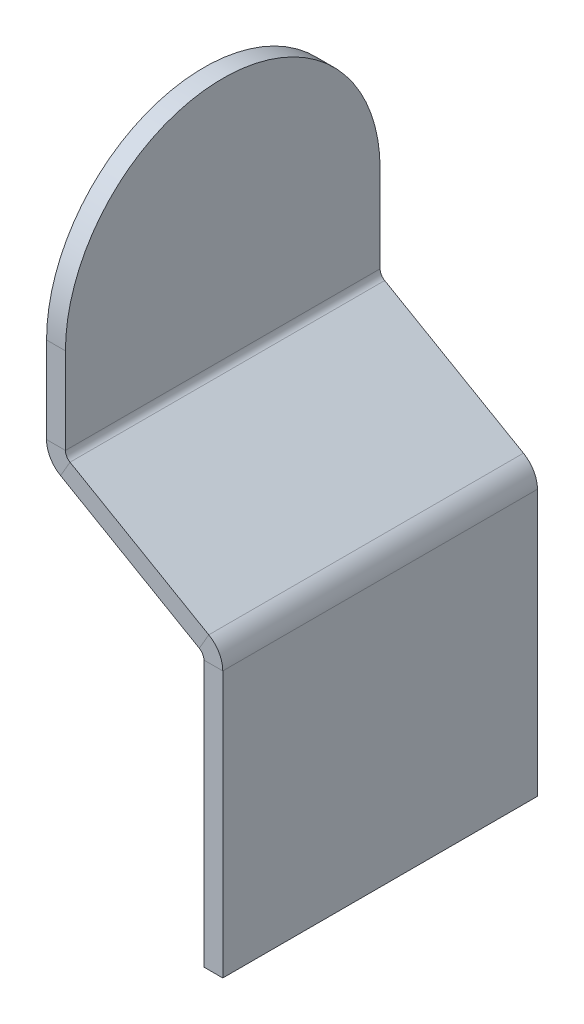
ISO-10303-21;
HEADER;
FILE_DESCRIPTION(('STEP AP214'),'2;1');
FILE_NAME('part.step','',(''),(''),'','','');
FILE_SCHEMA(('AUTOMOTIVE_DESIGN { 1 0 10303 214 1 1 1 1 }'));
ENDSEC;
DATA;
#1=APPLICATION_CONTEXT('core data for automotive mechanical design processes');
#2=APPLICATION_PROTOCOL_DEFINITION('international standard','automotive_design',2000,#1);
#3=PRODUCT_CONTEXT('',#1,'mechanical');
#4=PRODUCT('Part','Part','',(#3));
#5=PRODUCT_RELATED_PRODUCT_CATEGORY('part','',(#4));
#6=PRODUCT_DEFINITION_FORMATION('','',#4);
#7=PRODUCT_DEFINITION_CONTEXT('part definition',#1,'design');
#8=PRODUCT_DEFINITION('design','',#6,#7);
#9=PRODUCT_DEFINITION_SHAPE('','',#8);
#10=(LENGTH_UNIT() NAMED_UNIT(*) SI_UNIT(.MILLI.,.METRE.));
#11=(NAMED_UNIT(*) PLANE_ANGLE_UNIT() SI_UNIT($,.RADIAN.));
#12=(NAMED_UNIT(*) SI_UNIT($,.STERADIAN.) SOLID_ANGLE_UNIT());
#13=UNCERTAINTY_MEASURE_WITH_UNIT(LENGTH_MEASURE(1.E-05),#10,'distance_accuracy_value','');
#14=(GEOMETRIC_REPRESENTATION_CONTEXT(3) GLOBAL_UNCERTAINTY_ASSIGNED_CONTEXT((#13)) GLOBAL_UNIT_ASSIGNED_CONTEXT((#10,
#11,#12)) REPRESENTATION_CONTEXT('',''));
#15=CARTESIAN_POINT('',(0.,0.,0.));
#16=DIRECTION('',(0.,0.,1.));
#17=DIRECTION('',(1.,0.,0.));
#18=AXIS2_PLACEMENT_3D('',#15,#16,#17);
#19=CARTESIAN_POINT('',(19.5806378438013,10.5861086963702,25.4));
#20=DIRECTION('',(-0.499999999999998,-0.86602540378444,0.));
#21=DIRECTION('',(0.,0.,1.));
#22=AXIS2_PLACEMENT_3D('',#19,#20,#21);
#23=PLANE('',#22);
#24=DIRECTION('',(-0.86602540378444,0.499999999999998,0.));
#25=VECTOR('',#24,1.);
#26=CARTESIAN_POINT('',(19.5806378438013,10.5861086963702,25.4));
#27=LINE('',#26,#25);
#28=CARTESIAN_POINT('',(-0.368300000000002,22.103633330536,25.4));
#29=VERTEX_POINT('',#28);
#30=CARTESIAN_POINT('',(-11.5697,28.5707646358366,25.4));
#31=VERTEX_POINT('',#30);
#32=EDGE_CURVE('E37',#29,#31,#27,.T.);
#33=ORIENTED_EDGE('',*,*,#32,.T.);
#34=DIRECTION('',(0.,0.,-1.));
#35=VECTOR('',#34,1.);
#36=CARTESIAN_POINT('',(-11.5697,28.5707646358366,25.4));
#37=LINE('',#36,#35);
#38=CARTESIAN_POINT('',(-11.5697000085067,28.5707646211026,0.));
#39=VERTEX_POINT('',#38);
#40=EDGE_CURVE('E222',#31,#39,#37,.T.);
#41=ORIENTED_EDGE('',*,*,#40,.T.);
#42=DIRECTION('',(-0.86602540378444,0.499999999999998,0.));
#43=VECTOR('',#42,1.);
#44=CARTESIAN_POINT('',(19.5806378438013,10.5861086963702,0.));
#45=LINE('',#44,#43);
#46=CARTESIAN_POINT('',(-0.368299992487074,22.1036333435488,0.));
#47=VERTEX_POINT('',#46);
#48=EDGE_CURVE('E229',#47,#39,#45,.T.);
#49=ORIENTED_EDGE('',*,*,#48,.F.);
#50=DIRECTION('',(0.,0.,-1.));
#51=VECTOR('',#50,1.);
#52=CARTESIAN_POINT('',(-0.368300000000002,22.103633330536,25.4));
#53=LINE('',#52,#51);
#54=EDGE_CURVE('E212',#29,#47,#53,.T.);
#55=ORIENTED_EDGE('',*,*,#54,.F.);
#56=EDGE_LOOP('',(#33,#41,#49,#55));
#57=FACE_BOUND('',#56,.T.);
#58=ADVANCED_FACE('F33',(#57),#23,.T.);
#59=CARTESIAN_POINT('',(20.3426378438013,11.9059314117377,25.4));
#60=DIRECTION('',(0.,0.,1.));
#61=DIRECTION('',(0.499999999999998,0.86602540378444,0.));
#62=AXIS2_PLACEMENT_3D('',#59,#60,#61);
#63=PLANE('',#62);
#64=DIRECTION('',(-0.86602540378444,0.499999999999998,0.));
#65=VECTOR('',#64,1.);
#66=CARTESIAN_POINT('',(20.3426378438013,11.9059314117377,25.4));
#67=LINE('',#66,#65);
#68=CARTESIAN_POINT('',(0.3937,23.4234560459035,25.4));
#69=VERTEX_POINT('',#68);
#70=CARTESIAN_POINT('',(-10.8077,29.8905873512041,25.4));
#71=VERTEX_POINT('',#70);
#72=EDGE_CURVE('E58',#69,#71,#67,.T.);
#73=ORIENTED_EDGE('',*,*,#72,.T.);
#74=DIRECTION('',(-0.499999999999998,-0.86602540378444,0.));
#75=VECTOR('',#74,1.);
#76=CARTESIAN_POINT('',(-10.8077,29.8905873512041,25.4));
#77=LINE('',#76,#75);
#78=EDGE_CURVE('E225',#71,#31,#77,.T.);
#79=ORIENTED_EDGE('',*,*,#78,.T.);
#80=ORIENTED_EDGE('',*,*,#32,.F.);
#81=DIRECTION('',(-0.499999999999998,-0.86602540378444,0.));
#82=VECTOR('',#81,1.);
#83=CARTESIAN_POINT('',(0.393699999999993,23.4234560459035,25.4));
#84=LINE('',#83,#82);
#85=EDGE_CURVE('E219',#69,#29,#84,.T.);
#86=ORIENTED_EDGE('',*,*,#85,.F.);
#87=EDGE_LOOP('',(#73,#79,#80,#86));
#88=FACE_BOUND('',#87,.T.);
#89=ADVANCED_FACE('F236',(#88),#63,.T.);
#90=CARTESIAN_POINT('',(20.3426378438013,11.9059314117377,0.));
#91=DIRECTION('',(0.,0.,1.));
#92=DIRECTION('',(0.499999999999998,0.86602540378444,0.));
#93=AXIS2_PLACEMENT_3D('',#90,#91,#92);
#94=PLANE('',#93);
#95=DIRECTION('',(-0.499999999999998,-0.86602540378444,0.));
#96=VECTOR('',#95,1.);
#97=CARTESIAN_POINT('',(-10.8077,29.8905873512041,0.));
#98=LINE('',#97,#96);
#99=CARTESIAN_POINT('',(-10.8077,29.8905873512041,0.));
#100=VERTEX_POINT('',#99);
#101=EDGE_CURVE('E12',#100,#39,#98,.T.);
#102=ORIENTED_EDGE('',*,*,#101,.F.);
#103=DIRECTION('',(-0.86602540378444,0.499999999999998,0.));
#104=VECTOR('',#103,1.);
#105=CARTESIAN_POINT('',(20.3426378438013,11.9059314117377,0.));
#106=LINE('',#105,#104);
#107=CARTESIAN_POINT('',(0.3937,23.4234560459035,0.));
#108=VERTEX_POINT('',#107);
#109=EDGE_CURVE('E50',#108,#100,#106,.T.);
#110=ORIENTED_EDGE('',*,*,#109,.F.);
#111=DIRECTION('',(-0.499999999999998,-0.86602540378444,0.));
#112=VECTOR('',#111,1.);
#113=CARTESIAN_POINT('',(0.393699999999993,23.4234560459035,0.));
#114=LINE('',#113,#112);
#115=EDGE_CURVE('E215',#108,#47,#114,.T.);
#116=ORIENTED_EDGE('',*,*,#115,.T.);
#117=ORIENTED_EDGE('',*,*,#48,.T.);
#118=EDGE_LOOP('',(#102,#110,#116,#117));
#119=FACE_BOUND('',#118,.T.);
#120=ADVANCED_FACE('F35',(#119),#94,.F.);
#121=CARTESIAN_POINT('',(20.3426378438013,11.9059314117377,25.4));
#122=DIRECTION('',(-0.499999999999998,-0.86602540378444,0.));
#123=DIRECTION('',(0.,0.,1.));
#124=AXIS2_PLACEMENT_3D('',#121,#122,#123);
#125=PLANE('',#124);
#126=DIRECTION('',(0.,0.,-1.));
#127=VECTOR('',#126,1.);
#128=CARTESIAN_POINT('',(-10.8077,29.8905873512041,25.4));
#129=LINE('',#128,#127);
#130=EDGE_CURVE('E42',#71,#100,#129,.T.);
#131=ORIENTED_EDGE('',*,*,#130,.F.);
#132=ORIENTED_EDGE('',*,*,#72,.F.);
#133=DIRECTION('',(0.,0.,-1.));
#134=VECTOR('',#133,1.);
#135=CARTESIAN_POINT('',(0.393699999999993,23.4234560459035,25.4));
#136=LINE('',#135,#134);
#137=EDGE_CURVE('E217',#69,#108,#136,.T.);
#138=ORIENTED_EDGE('',*,*,#137,.T.);
#139=ORIENTED_EDGE('',*,*,#109,.T.);
#140=EDGE_LOOP('',(#131,#132,#138,#139));
#141=FACE_BOUND('',#140,.T.);
#142=ADVANCED_FACE('F279',(#141),#125,.F.);
#143=CARTESIAN_POINT('',(1.524,0.,25.4));
#144=DIRECTION('',(0.,-1.,0.));
#145=DIRECTION('',(0.,0.,-1.));
#146=AXIS2_PLACEMENT_3D('',#143,#144,#145);
#147=PLANE('',#146);
#148=DIRECTION('',(-1.,0.,0.));
#149=VECTOR('',#148,1.);
#150=CARTESIAN_POINT('',(1.524,0.,0.));
#151=LINE('',#150,#149);
#152=CARTESIAN_POINT('',(1.524,0.,0.));
#153=VERTEX_POINT('',#152);
#154=CARTESIAN_POINT('',(0.,0.,0.));
#155=VERTEX_POINT('',#154);
#156=EDGE_CURVE('E194',#153,#155,#151,.T.);
#157=ORIENTED_EDGE('',*,*,#156,.F.);
#158=DIRECTION('',(0.,0.,-1.));
#159=VECTOR('',#158,1.);
#160=CARTESIAN_POINT('',(1.524,0.,25.4));
#161=LINE('',#160,#159);
#162=CARTESIAN_POINT('',(1.524,0.,25.4));
#163=VERTEX_POINT('',#162);
#164=EDGE_CURVE('E190',#163,#153,#161,.T.);
#165=ORIENTED_EDGE('',*,*,#164,.F.);
#166=DIRECTION('',(-1.,0.,0.));
#167=VECTOR('',#166,1.);
#168=CARTESIAN_POINT('',(1.524,0.,25.4));
#169=LINE('',#168,#167);
#170=CARTESIAN_POINT('',(0.,0.,25.4));
#171=VERTEX_POINT('',#170);
#172=EDGE_CURVE('E204',#163,#171,#169,.T.);
#173=ORIENTED_EDGE('',*,*,#172,.T.);
#174=DIRECTION('',(0.,0.,-1.));
#175=VECTOR('',#174,1.);
#176=CARTESIAN_POINT('',(0.,0.,25.4));
#177=LINE('',#176,#175);
#178=EDGE_CURVE('E202',#171,#155,#177,.T.);
#179=ORIENTED_EDGE('',*,*,#178,.T.);
#180=EDGE_LOOP('',(#157,#165,#173,#179));
#181=FACE_BOUND('',#180,.T.);
#182=ADVANCED_FACE('F281',(#181),#147,.T.);
#183=CARTESIAN_POINT('',(0.,0.,25.4));
#184=DIRECTION('',(-1.,0.,0.));
#185=DIRECTION('',(0.,0.,1.));
#186=AXIS2_PLACEMENT_3D('',#183,#184,#185);
#187=PLANE('',#186);
#188=DIRECTION('',(0.,1.,0.));
#189=VECTOR('',#188,1.);
#190=CARTESIAN_POINT('',(0.,0.,25.4));
#191=LINE('',#190,#189);
#192=CARTESIAN_POINT('',(0.,21.4657190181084,25.4));
#193=VERTEX_POINT('',#192);
#194=EDGE_CURVE('E200',#171,#193,#191,.T.);
#195=ORIENTED_EDGE('',*,*,#194,.T.);
#196=DIRECTION('',(0.,0.,-1.));
#197=VECTOR('',#196,1.);
#198=CARTESIAN_POINT('',(0.,21.4657190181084,25.4));
#199=LINE('',#198,#197);
#200=CARTESIAN_POINT('',(1.50258540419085E-08,21.4657190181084,0.));
#201=VERTEX_POINT('',#200);
#202=EDGE_CURVE('E197',#193,#201,#199,.T.);
#203=ORIENTED_EDGE('',*,*,#202,.T.);
#204=DIRECTION('',(0.,1.,0.));
#205=VECTOR('',#204,1.);
#206=CARTESIAN_POINT('',(0.,0.,0.));
#207=LINE('',#206,#205);
#208=EDGE_CURVE('E192',#155,#201,#207,.T.);
#209=ORIENTED_EDGE('',*,*,#208,.F.);
#210=ORIENTED_EDGE('',*,*,#178,.F.);
#211=EDGE_LOOP('',(#195,#203,#209,#210));
#212=FACE_BOUND('',#211,.T.);
#213=ADVANCED_FACE('F286',(#212),#187,.T.);
#214=CARTESIAN_POINT('',(1.524,0.,0.));
#215=DIRECTION('',(0.,0.,1.));
#216=DIRECTION('',(1.,0.,0.));
#217=AXIS2_PLACEMENT_3D('',#214,#215,#216);
#218=PLANE('',#217);
#219=DIRECTION('',(-1.,0.,0.));
#220=VECTOR('',#219,1.);
#221=CARTESIAN_POINT('',(1.524,21.4657190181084,0.));
#222=LINE('',#221,#220);
#223=CARTESIAN_POINT('',(1.524,21.4657190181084,0.));
#224=VERTEX_POINT('',#223);
#225=EDGE_CURVE('E207',#224,#201,#222,.T.);
#226=ORIENTED_EDGE('',*,*,#225,.F.);
#227=DIRECTION('',(0.,1.,0.));
#228=VECTOR('',#227,1.);
#229=CARTESIAN_POINT('',(1.524,0.,0.));
#230=LINE('',#229,#228);
#231=EDGE_CURVE('E188',#153,#224,#230,.T.);
#232=ORIENTED_EDGE('',*,*,#231,.F.);
#233=ORIENTED_EDGE('',*,*,#156,.T.);
#234=ORIENTED_EDGE('',*,*,#208,.T.);
#235=EDGE_LOOP('',(#226,#232,#233,#234));
#236=FACE_BOUND('',#235,.T.);
#237=ADVANCED_FACE('F304',(#236),#218,.F.);
#238=CARTESIAN_POINT('',(1.524,0.,25.4));
#239=DIRECTION('',(-1.,0.,0.));
#240=DIRECTION('',(0.,0.,1.));
#241=AXIS2_PLACEMENT_3D('',#238,#239,#240);
#242=PLANE('',#241);
#243=DIRECTION('',(0.,0.,-1.));
#244=VECTOR('',#243,1.);
#245=CARTESIAN_POINT('',(1.524,21.4657190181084,25.4));
#246=LINE('',#245,#244);
#247=CARTESIAN_POINT('',(1.524,21.4657190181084,25.4));
#248=VERTEX_POINT('',#247);
#249=EDGE_CURVE('E182',#248,#224,#246,.T.);
#250=ORIENTED_EDGE('',*,*,#249,.F.);
#251=DIRECTION('',(0.,1.,0.));
#252=VECTOR('',#251,1.);
#253=CARTESIAN_POINT('',(1.524,0.,25.4));
#254=LINE('',#253,#252);
#255=EDGE_CURVE('E186',#163,#248,#254,.T.);
#256=ORIENTED_EDGE('',*,*,#255,.F.);
#257=ORIENTED_EDGE('',*,*,#164,.T.);
#258=ORIENTED_EDGE('',*,*,#231,.T.);
#259=EDGE_LOOP('',(#250,#256,#257,#258));
#260=FACE_BOUND('',#259,.T.);
#261=ADVANCED_FACE('F315',(#260),#242,.F.);
#262=CARTESIAN_POINT('',(1.524,0.,25.4));
#263=DIRECTION('',(0.,0.,1.));
#264=DIRECTION('',(1.,0.,0.));
#265=AXIS2_PLACEMENT_3D('',#262,#263,#264);
#266=PLANE('',#265);
#267=ORIENTED_EDGE('',*,*,#255,.T.);
#268=DIRECTION('',(-1.,0.,0.));
#269=VECTOR('',#268,1.);
#270=CARTESIAN_POINT('',(1.524,21.4657190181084,25.4));
#271=LINE('',#270,#269);
#272=EDGE_CURVE('E183',#248,#193,#271,.T.);
#273=ORIENTED_EDGE('',*,*,#272,.T.);
#274=ORIENTED_EDGE('',*,*,#194,.F.);
#275=ORIENTED_EDGE('',*,*,#172,.F.);
#276=EDGE_LOOP('',(#267,#273,#274,#275));
#277=FACE_BOUND('',#276,.T.);
#278=ADVANCED_FACE('F277',(#277),#266,.T.);
#279=CARTESIAN_POINT('',(-0.736600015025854,21.4657190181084,25.4));
#280=DIRECTION('',(0.,0.,-1.));
#281=DIRECTION('',(-1.,0.,0.));
#282=AXIS2_PLACEMENT_3D('',#279,#280,#281);
#283=PLANE('',#282);
#284=ORIENTED_EDGE('',*,*,#272,.F.);
#285=CARTESIAN_POINT('',(-0.7366,21.4657190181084,25.4));
#286=DIRECTION('',(0.,0.,-1.));
#287=DIRECTION('',(-1.,0.,0.));
#288=AXIS2_PLACEMENT_3D('',#285,#286,#287);
#289=CIRCLE('',#288,2.26060001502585);
#290=EDGE_CURVE('E170',#248,#69,#289,.F.);
#291=ORIENTED_EDGE('',*,*,#290,.T.);
#292=ORIENTED_EDGE('',*,*,#85,.T.);
#293=CARTESIAN_POINT('',(-0.736600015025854,21.4657190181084,25.4));
#294=DIRECTION('',(0.,0.,1.));
#295=DIRECTION('',(1.,0.,0.));
#296=AXIS2_PLACEMENT_3D('',#293,#294,#295);
#297=CIRCLE('',#296,0.736600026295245);
#298=EDGE_CURVE('E176',#193,#29,#297,.T.);
#299=ORIENTED_EDGE('',*,*,#298,.F.);
#300=EDGE_LOOP('',(#284,#291,#292,#299));
#301=FACE_BOUND('',#300,.T.);
#302=ADVANCED_FACE('F318',(#301),#283,.F.);
#303=CARTESIAN_POINT('',(-0.736600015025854,21.4657190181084,0.));
#304=DIRECTION('',(0.,0.,1.));
#305=DIRECTION('',(1.,0.,0.));
#306=AXIS2_PLACEMENT_3D('',#303,#304,#305);
#307=PLANE('',#306);
#308=CARTESIAN_POINT('',(-0.7366,21.4657190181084,0.));
#309=DIRECTION('',(0.,0.,-1.));
#310=DIRECTION('',(-1.,0.,0.));
#311=AXIS2_PLACEMENT_3D('',#308,#309,#310);
#312=CIRCLE('',#311,2.26060001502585);
#313=EDGE_CURVE('E173',#108,#224,#312,.T.);
#314=ORIENTED_EDGE('',*,*,#313,.T.);
#315=ORIENTED_EDGE('',*,*,#225,.T.);
#316=CARTESIAN_POINT('',(-0.736600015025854,21.4657190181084,0.));
#317=DIRECTION('',(0.,0.,-1.));
#318=DIRECTION('',(1.,0.,0.));
#319=AXIS2_PLACEMENT_3D('',#316,#317,#318);
#320=CIRCLE('',#319,0.736600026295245);
#321=EDGE_CURVE('E179',#47,#201,#320,.T.);
#322=ORIENTED_EDGE('',*,*,#321,.F.);
#323=ORIENTED_EDGE('',*,*,#115,.F.);
#324=EDGE_LOOP('',(#314,#315,#322,#323));
#325=FACE_BOUND('',#324,.T.);
#326=ADVANCED_FACE('F299',(#325),#307,.F.);
#327=CARTESIAN_POINT('',(-0.7366,21.4657190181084,38.1940262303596));
#328=DIRECTION('',(0.,0.,-1.));
#329=DIRECTION('',(-1.,0.,0.));
#330=AXIS2_PLACEMENT_3D('',#327,#328,#329);
#331=CYLINDRICAL_SURFACE('',#330,0.736600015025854);
#332=ORIENTED_EDGE('',*,*,#54,.T.);
#333=ORIENTED_EDGE('',*,*,#321,.T.);
#334=ORIENTED_EDGE('',*,*,#202,.F.);
#335=ORIENTED_EDGE('',*,*,#298,.T.);
#336=EDGE_LOOP('',(#332,#333,#334,#335));
#337=FACE_BOUND('',#336,.T.);
#338=ADVANCED_FACE('F295',(#337),#331,.F.);
#339=CARTESIAN_POINT('',(-0.7366,21.4657190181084,38.1940262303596));
#340=DIRECTION('',(0.,0.,-1.));
#341=DIRECTION('',(-1.,0.,0.));
#342=AXIS2_PLACEMENT_3D('',#339,#340,#341);
#343=CYLINDRICAL_SURFACE('',#342,2.26060001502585);
#344=ORIENTED_EDGE('',*,*,#137,.F.);
#345=ORIENTED_EDGE('',*,*,#290,.F.);
#346=ORIENTED_EDGE('',*,*,#249,.T.);
#347=ORIENTED_EDGE('',*,*,#313,.F.);
#348=EDGE_LOOP('',(#344,#345,#346,#347));
#349=FACE_BOUND('',#348,.T.);
#350=ADVANCED_FACE('F311',(#349),#343,.T.);
#351=CARTESIAN_POINT('',(-10.4393999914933,30.5285016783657,25.4));
#352=DIRECTION('',(0.,0.,1.));
#353=DIRECTION('',(1.,0.,0.));
#354=AXIS2_PLACEMENT_3D('',#351,#352,#353);
#355=PLANE('',#354);
#356=ORIENTED_EDGE('',*,*,#78,.F.);
#357=CARTESIAN_POINT('',(-10.4394,30.5285016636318,25.4));
#358=DIRECTION('',(0.,0.,-1.));
#359=DIRECTION('',(-1.,0.,0.));
#360=AXIS2_PLACEMENT_3D('',#357,#358,#359);
#361=CIRCLE('',#360,0.736600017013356);
#362=CARTESIAN_POINT('',(-11.176,30.5285016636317,25.4));
#363=VERTEX_POINT('',#362);
#364=EDGE_CURVE('E144',#71,#363,#361,.T.);
#365=ORIENTED_EDGE('',*,*,#364,.T.);
#366=DIRECTION('',(-1.,0.,0.));
#367=VECTOR('',#366,1.);
#368=CARTESIAN_POINT('',(-11.176,30.5285016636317,25.4));
#369=LINE('',#368,#367);
#370=CARTESIAN_POINT('',(-12.7,30.5285016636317,25.4));
#371=VERTEX_POINT('',#370);
#372=EDGE_CURVE('E150',#363,#371,#369,.T.);
#373=ORIENTED_EDGE('',*,*,#372,.T.);
#374=CARTESIAN_POINT('',(-10.4393999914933,30.5285016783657,25.4));
#375=DIRECTION('',(0.,0.,-1.));
#376=DIRECTION('',(-1.,0.,0.));
#377=AXIS2_PLACEMENT_3D('',#374,#375,#376);
#378=CIRCLE('',#377,2.26060002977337);
#379=EDGE_CURVE('E164',#31,#371,#378,.T.);
#380=ORIENTED_EDGE('',*,*,#379,.F.);
#381=EDGE_LOOP('',(#356,#365,#373,#380));
#382=FACE_BOUND('',#381,.T.);
#383=ADVANCED_FACE('F243',(#382),#355,.T.);
#384=CARTESIAN_POINT('',(-10.4393999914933,30.5285016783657,0.));
#385=DIRECTION('',(0.,0.,-1.));
#386=DIRECTION('',(-1.,0.,0.));
#387=AXIS2_PLACEMENT_3D('',#384,#385,#386);
#388=PLANE('',#387);
#389=CARTESIAN_POINT('',(-10.4394,30.5285016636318,0.));
#390=DIRECTION('',(0.,0.,-1.));
#391=DIRECTION('',(-1.,0.,0.));
#392=AXIS2_PLACEMENT_3D('',#389,#390,#391);
#393=CIRCLE('',#392,0.736600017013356);
#394=CARTESIAN_POINT('',(-11.176,30.5285016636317,0.));
#395=VERTEX_POINT('',#394);
#396=EDGE_CURVE('E161',#395,#100,#393,.F.);
#397=ORIENTED_EDGE('',*,*,#396,.T.);
#398=ORIENTED_EDGE('',*,*,#101,.T.);
#399=CARTESIAN_POINT('',(-10.4393999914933,30.5285016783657,0.));
#400=DIRECTION('',(0.,0.,1.));
#401=DIRECTION('',(-1.,0.,0.));
#402=AXIS2_PLACEMENT_3D('',#399,#400,#401);
#403=CIRCLE('',#402,2.26060002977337);
#404=CARTESIAN_POINT('',(-12.7000000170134,30.5285016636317,0.));
#405=VERTEX_POINT('',#404);
#406=EDGE_CURVE('E167',#405,#39,#403,.T.);
#407=ORIENTED_EDGE('',*,*,#406,.F.);
#408=DIRECTION('',(-1.,0.,0.));
#409=VECTOR('',#408,1.);
#410=CARTESIAN_POINT('',(-11.176,30.5285016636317,0.));
#411=LINE('',#410,#409);
#412=EDGE_CURVE('E130',#395,#405,#411,.T.);
#413=ORIENTED_EDGE('',*,*,#412,.F.);
#414=EDGE_LOOP('',(#397,#398,#407,#413));
#415=FACE_BOUND('',#414,.T.);
#416=ADVANCED_FACE('F291',(#415),#388,.T.);
#417=CARTESIAN_POINT('',(-10.4394,30.5285016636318,38.2751412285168));
#418=DIRECTION('',(0.,0.,-1.));
#419=DIRECTION('',(-1.,0.,0.));
#420=AXIS2_PLACEMENT_3D('',#417,#418,#419);
#421=CYLINDRICAL_SURFACE('',#420,2.26060001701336);
#422=DIRECTION('',(0.,0.,-1.));
#423=VECTOR('',#422,1.);
#424=CARTESIAN_POINT('',(-12.7,30.5285016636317,25.4));
#425=LINE('',#424,#423);
#426=EDGE_CURVE('E154',#371,#405,#425,.T.);
#427=ORIENTED_EDGE('',*,*,#426,.T.);
#428=ORIENTED_EDGE('',*,*,#406,.T.);
#429=ORIENTED_EDGE('',*,*,#40,.F.);
#430=ORIENTED_EDGE('',*,*,#379,.T.);
#431=EDGE_LOOP('',(#427,#428,#429,#430));
#432=FACE_BOUND('',#431,.T.);
#433=ADVANCED_FACE('F241',(#432),#421,.T.);
#434=CARTESIAN_POINT('',(-10.4394,30.5285016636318,38.2751412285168));
#435=DIRECTION('',(0.,0.,-1.));
#436=DIRECTION('',(-1.,0.,0.));
#437=AXIS2_PLACEMENT_3D('',#434,#435,#436);
#438=CYLINDRICAL_SURFACE('',#437,0.736600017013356);
#439=DIRECTION('',(0.,0.,-1.));
#440=VECTOR('',#439,1.);
#441=CARTESIAN_POINT('',(-11.176,30.5285016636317,25.4));
#442=LINE('',#441,#440);
#443=EDGE_CURVE('E252',#363,#395,#442,.T.);
#444=ORIENTED_EDGE('',*,*,#443,.F.);
#445=ORIENTED_EDGE('',*,*,#364,.F.);
#446=ORIENTED_EDGE('',*,*,#130,.T.);
#447=ORIENTED_EDGE('',*,*,#396,.F.);
#448=EDGE_LOOP('',(#444,#445,#446,#447));
#449=FACE_BOUND('',#448,.T.);
#450=ADVANCED_FACE('F253',(#449),#438,.F.);
#451=CARTESIAN_POINT('',(-12.7,37.4906278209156,12.7));
#452=DIRECTION('',(1.,0.,0.));
#453=DIRECTION('',(0.,0.,-1.));
#454=AXIS2_PLACEMENT_3D('',#451,#452,#453);
#455=CYLINDRICAL_SURFACE('',#454,12.7);
#456=CARTESIAN_POINT('',(-11.176,37.4906278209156,12.7));
#457=DIRECTION('',(1.,0.,0.));
#458=DIRECTION('',(0.,0.,1.));
#459=AXIS2_PLACEMENT_3D('',#456,#457,#458);
#460=CIRCLE('',#459,12.7);
#461=CARTESIAN_POINT('',(-11.176,37.4906278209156,0.));
#462=VERTEX_POINT('',#461);
#463=CARTESIAN_POINT('',(-11.176,37.4906278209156,25.4));
#464=VERTEX_POINT('',#463);
#465=EDGE_CURVE('E143',#462,#464,#460,.T.);
#466=ORIENTED_EDGE('',*,*,#465,.F.);
#467=DIRECTION('',(1.,0.,0.));
#468=VECTOR('',#467,1.);
#469=CARTESIAN_POINT('',(-12.7,37.4906278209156,0.));
#470=LINE('',#469,#468);
#471=CARTESIAN_POINT('',(-12.7,37.4906278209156,0.));
#472=VERTEX_POINT('',#471);
#473=EDGE_CURVE('E128',#472,#462,#470,.T.);
#474=ORIENTED_EDGE('',*,*,#473,.F.);
#475=CARTESIAN_POINT('',(-12.7,37.4906278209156,12.7));
#476=DIRECTION('',(1.,0.,0.));
#477=DIRECTION('',(0.,0.,1.));
#478=AXIS2_PLACEMENT_3D('',#475,#476,#477);
#479=CIRCLE('',#478,12.7);
#480=CARTESIAN_POINT('',(-12.7,37.4906278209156,25.4));
#481=VERTEX_POINT('',#480);
#482=EDGE_CURVE('E140',#472,#481,#479,.T.);
#483=ORIENTED_EDGE('',*,*,#482,.T.);
#484=DIRECTION('',(1.,0.,0.));
#485=VECTOR('',#484,1.);
#486=CARTESIAN_POINT('',(-12.7,37.4906278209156,25.4));
#487=LINE('',#486,#485);
#488=EDGE_CURVE('E149',#481,#464,#487,.T.);
#489=ORIENTED_EDGE('',*,*,#488,.T.);
#490=EDGE_LOOP('',(#466,#474,#483,#489));
#491=FACE_BOUND('',#490,.T.);
#492=ADVANCED_FACE('F138',(#491),#455,.T.);
#493=CARTESIAN_POINT('',(-12.7,-7.01014046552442,25.4));
#494=DIRECTION('',(-1.,0.,0.));
#495=DIRECTION('',(0.,0.,1.));
#496=AXIS2_PLACEMENT_3D('',#493,#494,#495);
#497=PLANE('',#496);
#498=ORIENTED_EDGE('',*,*,#426,.F.);
#499=DIRECTION('',(0.,1.,0.));
#500=VECTOR('',#499,1.);
#501=CARTESIAN_POINT('',(-12.7,-7.01014046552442,25.4));
#502=LINE('',#501,#500);
#503=EDGE_CURVE('E148',#371,#481,#502,.T.);
#504=ORIENTED_EDGE('',*,*,#503,.T.);
#505=ORIENTED_EDGE('',*,*,#482,.F.);
#506=DIRECTION('',(0.,1.,0.));
#507=VECTOR('',#506,1.);
#508=CARTESIAN_POINT('',(-12.7,-7.01014046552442,0.));
#509=LINE('',#508,#507);
#510=EDGE_CURVE('E125',#405,#472,#509,.T.);
#511=ORIENTED_EDGE('',*,*,#510,.F.);
#512=EDGE_LOOP('',(#498,#504,#505,#511));
#513=FACE_BOUND('',#512,.T.);
#514=ADVANCED_FACE('F146',(#513),#497,.T.);
#515=CARTESIAN_POINT('',(-11.176,-7.01014046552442,25.4));
#516=DIRECTION('',(0.,0.,1.));
#517=DIRECTION('',(1.,0.,0.));
#518=AXIS2_PLACEMENT_3D('',#515,#516,#517);
#519=PLANE('',#518);
#520=ORIENTED_EDGE('',*,*,#372,.F.);
#521=DIRECTION('',(0.,1.,0.));
#522=VECTOR('',#521,1.);
#523=CARTESIAN_POINT('',(-11.176,-7.01014046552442,25.4));
#524=LINE('',#523,#522);
#525=EDGE_CURVE('E248',#363,#464,#524,.T.);
#526=ORIENTED_EDGE('',*,*,#525,.T.);
#527=ORIENTED_EDGE('',*,*,#488,.F.);
#528=ORIENTED_EDGE('',*,*,#503,.F.);
#529=EDGE_LOOP('',(#520,#526,#527,#528));
#530=FACE_BOUND('',#529,.T.);
#531=ADVANCED_FACE('F247',(#530),#519,.T.);
#532=CARTESIAN_POINT('',(-11.176,-7.01014046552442,25.4));
#533=DIRECTION('',(-1.,0.,0.));
#534=DIRECTION('',(0.,0.,1.));
#535=AXIS2_PLACEMENT_3D('',#532,#533,#534);
#536=PLANE('',#535);
#537=ORIENTED_EDGE('',*,*,#525,.F.);
#538=ORIENTED_EDGE('',*,*,#443,.T.);
#539=DIRECTION('',(0.,1.,0.));
#540=VECTOR('',#539,1.);
#541=CARTESIAN_POINT('',(-11.176,-7.01014046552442,0.));
#542=LINE('',#541,#540);
#543=EDGE_CURVE('E255',#395,#462,#542,.T.);
#544=ORIENTED_EDGE('',*,*,#543,.T.);
#545=ORIENTED_EDGE('',*,*,#465,.T.);
#546=EDGE_LOOP('',(#537,#538,#544,#545));
#547=FACE_BOUND('',#546,.T.);
#548=ADVANCED_FACE('F261',(#547),#536,.F.);
#549=CARTESIAN_POINT('',(-11.176,-7.01014046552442,0.));
#550=DIRECTION('',(0.,0.,1.));
#551=DIRECTION('',(1.,0.,0.));
#552=AXIS2_PLACEMENT_3D('',#549,#550,#551);
#553=PLANE('',#552);
#554=ORIENTED_EDGE('',*,*,#543,.F.);
#555=ORIENTED_EDGE('',*,*,#412,.T.);
#556=ORIENTED_EDGE('',*,*,#510,.T.);
#557=ORIENTED_EDGE('',*,*,#473,.T.);
#558=EDGE_LOOP('',(#554,#555,#556,#557));
#559=FACE_BOUND('',#558,.T.);
#560=ADVANCED_FACE('F127',(#559),#553,.F.);
#561=CLOSED_SHELL('',(#58,#89,#120,#142,#182,#213,#237,#261,#278,#302,#326,#338,#350,#383,#416,
#433,#450,#492,#514,#531,#548,#560));
#562=MANIFOLD_SOLID_BREP('B2',#561);
#563=ADVANCED_BREP_SHAPE_REPRESENTATION('',(#18,#562),#14);
#564=SHAPE_DEFINITION_REPRESENTATION(#9,#563);
ENDSEC;
END-ISO-10303-21;
